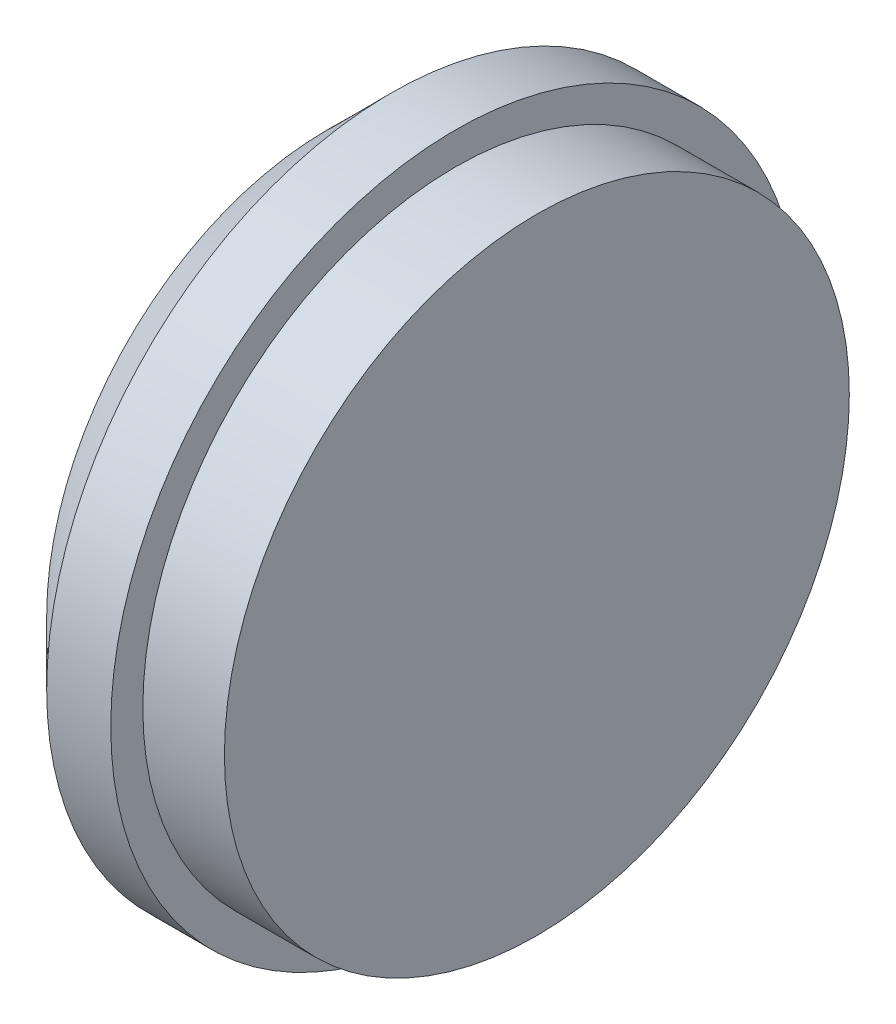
from build123d import *


with BuildPart() as part:
    # Sketch1 → Revolve1 (revolve)
    with BuildSketch(Plane.XY, mode=Mode.PRIVATE) as revolve1_sk:
        Polygon((-6.34746, 17.82826), (-6.34746, -3.45694), (-11.90498, -3.45694), (-11.90498, -5.64134), (-16.27124, -5.64134), (-20.63496, -1.27762), (-20.63496, 17.82826), align=None)
    revolve(revolve1_sk.sketch.rotate(Axis((-20.63496, 17.82826, 0), (1, 0, 0)), 270), axis=Axis((-20.63496, 17.82826, 0), (1, 0, 0)))


solid = part.part
